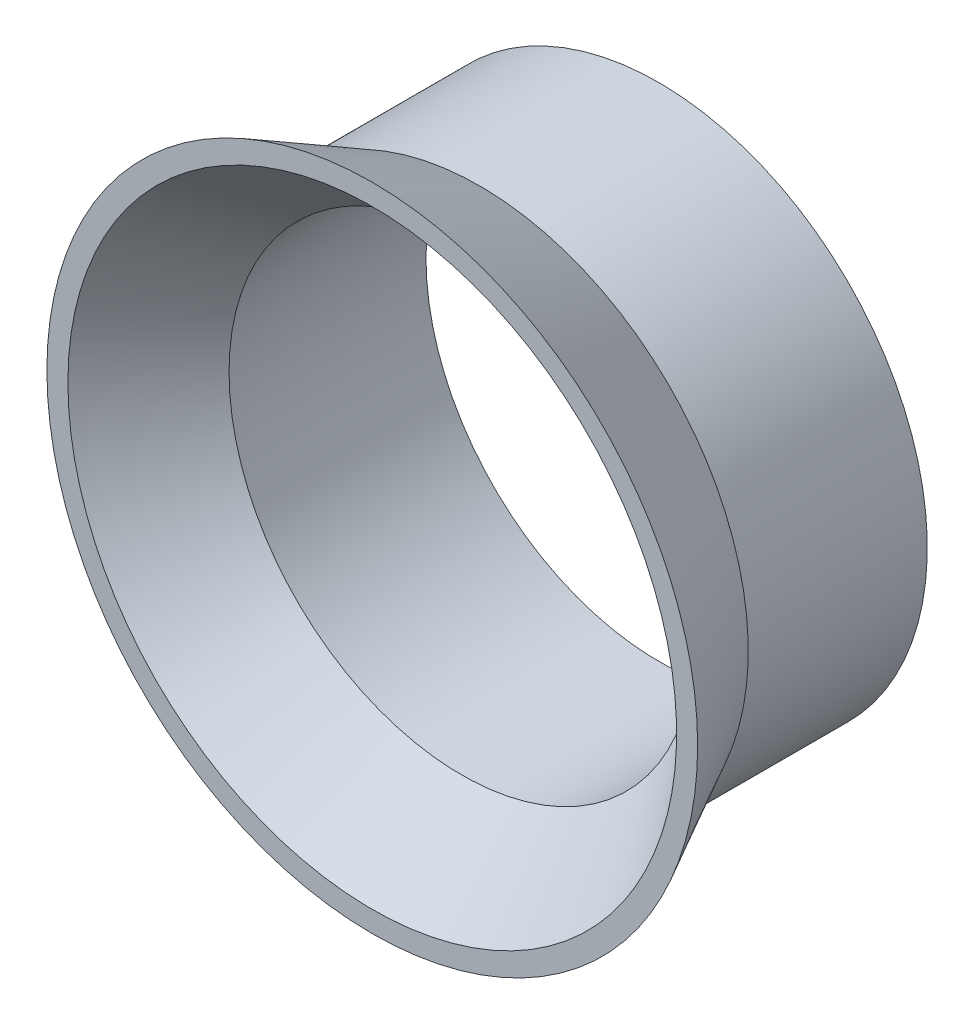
from build123d import *

# Parameters (mm, degrees)
SKETCH2_R           = 37
SKETCH2_R_2         = 31
BOSS_EXTRUDE1_DEPTH = 32
SKETCH3_R           = 31
BOSS_EXTRUDE3_DEPTH = 32


with BuildPart() as part:
    # Sketch2 → Boss-Extrude1 (new body)
    with BuildSketch(Plane.XY):
        Circle(SKETCH2_R)
        Circle(SKETCH2_R_2, mode=Mode.SUBTRACT)
    extrude(amount=BOSS_EXTRUDE1_DEPTH)

    # Sketch3 → Boss-Extrude3 (add)
    with BuildSketch(Plane.XY):
        Circle(SKETCH3_R)
    extrude(amount=BOSS_EXTRUDE3_DEPTH)

    # Sketch4 → Cut-Revolve1 (revolve, cut)
    with BuildSketch(Plane(origin=(0, 0, 0), x_dir=(1, 0, 0), z_dir=(0, 1, 0)), mode=Mode.PRIVATE) as cut_revolve1_sk:
        Polygon((30, 0), (30, -20), (36.346786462, -32), (37, -32), (37, 0), align=None)
    revolve(cut_revolve1_sk.sketch.rotate(Axis((0, 0, 0), (0, 0, 1)), 180), axis=Axis((0, 0, 0), (0, 0, 1)), mode=Mode.SUBTRACT)

    # Sketch5 → Cut-Revolve2 (revolve, cut)
    with BuildSketch(Plane(origin=(0, 0, 0), x_dir=(1, 0, 0), z_dir=(0, 1, 0)), mode=Mode.PRIVATE) as cut_revolve2_sk:
        Polygon((26, 0), (0, 0), (0, -32), (34, -32), (26, -22), align=None)
    revolve(cut_revolve2_sk.sketch.rotate(Axis((0, 0, 0), (0, 0, 1)), 180), axis=Axis((0, 0, 0), (0, 0, 1)), mode=Mode.SUBTRACT)


solid = part.part
